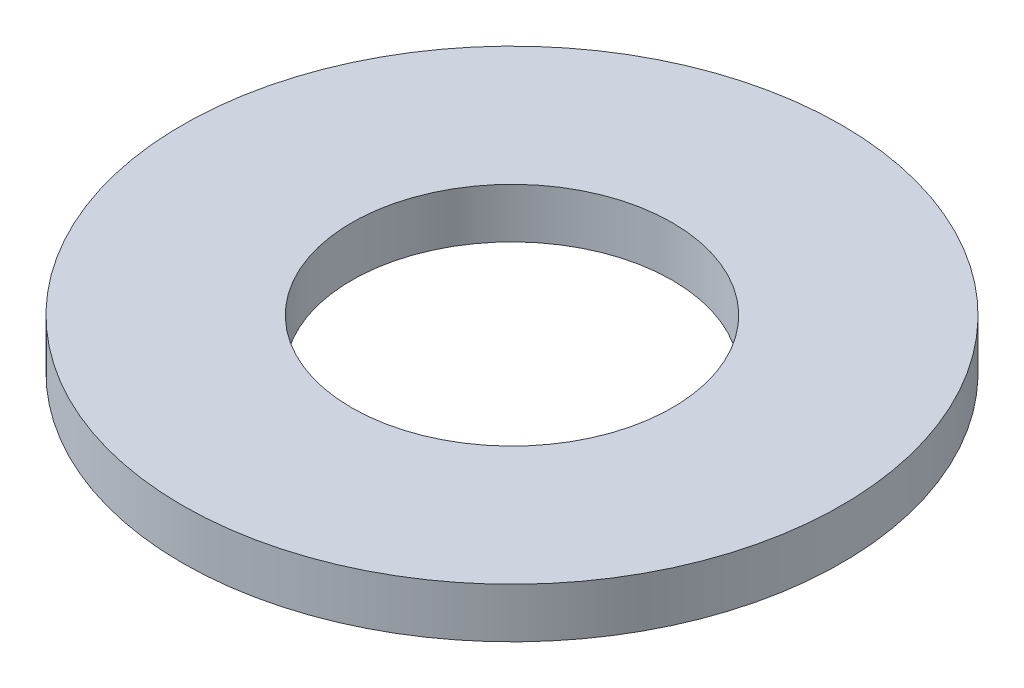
ISO-10303-21;
HEADER;
FILE_DESCRIPTION(('STEP AP214'),'2;1');
FILE_NAME('part.step','',(''),(''),'','','');
FILE_SCHEMA(('AUTOMOTIVE_DESIGN { 1 0 10303 214 1 1 1 1 }'));
ENDSEC;
DATA;
#1=APPLICATION_CONTEXT('core data for automotive mechanical design processes');
#2=APPLICATION_PROTOCOL_DEFINITION('international standard','automotive_design',2000,#1);
#3=PRODUCT_CONTEXT('',#1,'mechanical');
#4=PRODUCT('Part','Part','',(#3));
#5=PRODUCT_RELATED_PRODUCT_CATEGORY('part','',(#4));
#6=PRODUCT_DEFINITION_FORMATION('','',#4);
#7=PRODUCT_DEFINITION_CONTEXT('part definition',#1,'design');
#8=PRODUCT_DEFINITION('design','',#6,#7);
#9=PRODUCT_DEFINITION_SHAPE('','',#8);
#10=(LENGTH_UNIT() NAMED_UNIT(*) SI_UNIT(.MILLI.,.METRE.));
#11=(NAMED_UNIT(*) PLANE_ANGLE_UNIT() SI_UNIT($,.RADIAN.));
#12=(NAMED_UNIT(*) SI_UNIT($,.STERADIAN.) SOLID_ANGLE_UNIT());
#13=UNCERTAINTY_MEASURE_WITH_UNIT(LENGTH_MEASURE(1.E-05),#10,'distance_accuracy_value','');
#14=(GEOMETRIC_REPRESENTATION_CONTEXT(3) GLOBAL_UNCERTAINTY_ASSIGNED_CONTEXT((#13)) GLOBAL_UNIT_ASSIGNED_CONTEXT((#10,
#11,#12)) REPRESENTATION_CONTEXT('',''));
#15=CARTESIAN_POINT('',(0.,0.,0.));
#16=DIRECTION('',(0.,0.,1.));
#17=DIRECTION('',(1.,0.,0.));
#18=AXIS2_PLACEMENT_3D('',#15,#16,#17);
#19=CARTESIAN_POINT('',(0.,0.711200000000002,0.));
#20=DIRECTION('',(0.,-0.999999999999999,0.));
#21=DIRECTION('',(0.,0.,-1.));
#22=AXIS2_PLACEMENT_3D('',#19,#20,#21);
#23=CYLINDRICAL_SURFACE('',#22,4.699);
#24=CARTESIAN_POINT('',(0.,0.711200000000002,0.));
#25=DIRECTION('',(0.,0.999999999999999,0.));
#26=DIRECTION('',(0.,0.,1.));
#27=AXIS2_PLACEMENT_3D('',#24,#25,#26);
#28=CIRCLE('',#27,4.699);
#29=CARTESIAN_POINT('',(0.,0.711200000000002,-4.69899999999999));
#30=VERTEX_POINT('',#29);
#31=EDGE_CURVE('E10',#30,#30,#28,.T.);
#32=CARTESIAN_POINT('',(0.,0.,0.));
#33=DIRECTION('',(0.,0.999999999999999,0.));
#34=DIRECTION('',(0.,0.,1.));
#35=AXIS2_PLACEMENT_3D('',#32,#33,#34);
#36=CIRCLE('',#35,4.699);
#37=CARTESIAN_POINT('',(0.,0.,-4.69899999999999));
#38=VERTEX_POINT('',#37);
#39=EDGE_CURVE('E34',#38,#38,#36,.T.);
#40=CARTESIAN_POINT('',(0.,0.711200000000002,-4.69899999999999));
#41=CARTESIAN_POINT('',(0.,0.703791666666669,-4.69899999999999));
#42=CARTESIAN_POINT('',(0.,0.696383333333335,-4.69899999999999));
#43=CARTESIAN_POINT('',(0.,0.681566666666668,-4.69899999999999));
#44=CARTESIAN_POINT('',(0.,0.674158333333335,-4.69899999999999));
#45=CARTESIAN_POINT('',(0.,0.659341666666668,-4.69899999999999));
#46=CARTESIAN_POINT('',(0.,0.651933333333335,-4.69899999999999));
#47=CARTESIAN_POINT('',(0.,0.637116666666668,-4.69899999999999));
#48=CARTESIAN_POINT('',(0.,0.629708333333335,-4.69899999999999));
#49=CARTESIAN_POINT('',(0.,0.614891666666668,-4.69899999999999));
#50=CARTESIAN_POINT('',(0.,0.607483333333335,-4.69899999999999));
#51=CARTESIAN_POINT('',(0.,0.592666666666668,-4.69899999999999));
#52=CARTESIAN_POINT('',(0.,0.585258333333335,-4.69899999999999));
#53=CARTESIAN_POINT('',(0.,0.570441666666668,-4.69899999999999));
#54=CARTESIAN_POINT('',(0.,0.563033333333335,-4.69899999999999));
#55=CARTESIAN_POINT('',(0.,0.548216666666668,-4.69899999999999));
#56=CARTESIAN_POINT('',(0.,0.540808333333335,-4.69899999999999));
#57=CARTESIAN_POINT('',(0.,0.525991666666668,-4.69899999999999));
#58=CARTESIAN_POINT('',(0.,0.518583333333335,-4.69899999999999));
#59=CARTESIAN_POINT('',(0.,0.503766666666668,-4.69899999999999));
#60=CARTESIAN_POINT('',(0.,0.496358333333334,-4.69899999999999));
#61=CARTESIAN_POINT('',(0.,0.481541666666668,-4.69899999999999));
#62=CARTESIAN_POINT('',(0.,0.474133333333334,-4.69899999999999));
#63=CARTESIAN_POINT('',(0.,0.459316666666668,-4.69899999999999));
#64=CARTESIAN_POINT('',(0.,0.451908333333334,-4.69899999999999));
#65=CARTESIAN_POINT('',(0.,0.437091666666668,-4.69899999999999));
#66=CARTESIAN_POINT('',(0.,0.429683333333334,-4.69899999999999));
#67=CARTESIAN_POINT('',(0.,0.414866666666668,-4.69899999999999));
#68=CARTESIAN_POINT('',(0.,0.407458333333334,-4.69899999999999));
#69=CARTESIAN_POINT('',(0.,0.392641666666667,-4.69899999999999));
#70=CARTESIAN_POINT('',(0.,0.385233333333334,-4.69899999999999));
#71=CARTESIAN_POINT('',(0.,0.370416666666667,-4.69899999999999));
#72=CARTESIAN_POINT('',(0.,0.363008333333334,-4.69899999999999));
#73=CARTESIAN_POINT('',(0.,0.348191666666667,-4.69899999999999));
#74=CARTESIAN_POINT('',(0.,0.340783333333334,-4.69899999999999));
#75=CARTESIAN_POINT('',(0.,0.325966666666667,-4.69899999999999));
#76=CARTESIAN_POINT('',(0.,0.318558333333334,-4.69899999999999));
#77=CARTESIAN_POINT('',(0.,0.303741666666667,-4.69899999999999));
#78=CARTESIAN_POINT('',(0.,0.296333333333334,-4.69899999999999));
#79=CARTESIAN_POINT('',(0.,0.281516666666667,-4.69899999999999));
#80=CARTESIAN_POINT('',(0.,0.274108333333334,-4.69899999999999));
#81=CARTESIAN_POINT('',(0.,0.259291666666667,-4.69899999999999));
#82=CARTESIAN_POINT('',(0.,0.251883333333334,-4.69899999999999));
#83=CARTESIAN_POINT('',(0.,0.237066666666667,-4.69899999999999));
#84=CARTESIAN_POINT('',(0.,0.229658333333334,-4.69899999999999));
#85=CARTESIAN_POINT('',(0.,0.214841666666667,-4.69899999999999));
#86=CARTESIAN_POINT('',(0.,0.207433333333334,-4.69899999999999));
#87=CARTESIAN_POINT('',(0.,0.192616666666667,-4.69899999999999));
#88=CARTESIAN_POINT('',(0.,0.185208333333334,-4.69899999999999));
#89=CARTESIAN_POINT('',(0.,0.170391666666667,-4.69899999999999));
#90=CARTESIAN_POINT('',(0.,0.162983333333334,-4.69899999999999));
#91=CARTESIAN_POINT('',(0.,0.148166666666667,-4.69899999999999));
#92=CARTESIAN_POINT('',(0.,0.140758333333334,-4.69899999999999));
#93=CARTESIAN_POINT('',(0.,0.125941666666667,-4.69899999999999));
#94=CARTESIAN_POINT('',(0.,0.118533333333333,-4.69899999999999));
#95=CARTESIAN_POINT('',(0.,0.103716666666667,-4.69899999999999));
#96=CARTESIAN_POINT('',(0.,0.0963083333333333,-4.69899999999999));
#97=CARTESIAN_POINT('',(0.,0.0814916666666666,-4.69899999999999));
#98=CARTESIAN_POINT('',(0.,0.0740833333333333,-4.69899999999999));
#99=CARTESIAN_POINT('',(0.,0.0592666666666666,-4.69899999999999));
#100=CARTESIAN_POINT('',(0.,0.0518583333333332,-4.69899999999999));
#101=CARTESIAN_POINT('',(0.,0.0370416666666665,-4.69899999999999));
#102=CARTESIAN_POINT('',(0.,0.0296333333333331,-4.69899999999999));
#103=CARTESIAN_POINT('',(0.,0.0148166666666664,-4.69899999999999));
#104=CARTESIAN_POINT('',(0.,0.00740833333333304,-4.69899999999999));
#105=CARTESIAN_POINT('',(0.,0.,-4.69899999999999));
#106=B_SPLINE_CURVE_WITH_KNOTS('',3,(#40,#41,#42,#43,#44,#45,#46,#47,#48,#49,#50,#51,#52,#53,
#54,#55,#56,#57,#58,#59,#60,#61,#62,#63,#64,#65,#66,#67,#68,#69,#70,#71,#72,#73,#74,#75,#76,#77,
#78,#79,#80,#81,#82,#83,#84,#85,#86,#87,#88,#89,#90,#91,#92,#93,#94,#95,#96,#97,#98,#99,#100,
#101,#102,#103,#104,#105),.UNSPECIFIED.,.F.,.F.,(4,2,2,2,2,2,2,2,2,2,2,2,2,2,2,2,2,2,2,2,2,2,2,
2,2,2,2,2,2,2,2,2,4),(0.,0.0222250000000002,0.0444500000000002,0.0666750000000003,
0.0889000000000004,0.111125,0.13335,0.155575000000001,0.177800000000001,0.200025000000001,
0.222250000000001,0.244475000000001,0.266700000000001,0.288925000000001,0.311150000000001,
0.333375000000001,0.355600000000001,0.377825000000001,0.400050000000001,0.422275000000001,
0.444500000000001,0.466725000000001,0.488950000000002,0.511175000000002,0.533400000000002,
0.555625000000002,0.577850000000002,0.600075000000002,0.622300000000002,0.644525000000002,
0.666750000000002,0.688975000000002,0.711200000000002),.UNSPECIFIED.);
#107=EDGE_CURVE('BSEAM28',#30,#38,#106,.T.);
#108=ORIENTED_EDGE('',*,*,#31,.F.);
#109=ORIENTED_EDGE('',*,*,#39,.T.);
#110=ORIENTED_EDGE('',*,*,#107,.T.);
#111=ORIENTED_EDGE('',*,*,#107,.F.);
#112=EDGE_LOOP('',(#108,#110,#109,#111));
#113=FACE_BOUND('',#112,.T.);
#114=ADVANCED_FACE('F28',(#113),#23,.T.);
#115=CARTESIAN_POINT('',(0.,0.711200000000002,0.));
#116=DIRECTION('',(0.,0.999999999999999,0.));
#117=DIRECTION('',(0.,0.,1.));
#118=AXIS2_PLACEMENT_3D('',#115,#116,#117);
#119=PLANE('',#118);
#120=CARTESIAN_POINT('',(0.,0.711200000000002,0.));
#121=DIRECTION('',(0.,-0.999999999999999,0.));
#122=DIRECTION('',(0.,0.,-1.));
#123=AXIS2_PLACEMENT_3D('',#120,#121,#122);
#124=CIRCLE('',#123,2.286);
#125=CARTESIAN_POINT('',(0.,0.711200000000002,-2.28599999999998));
#126=VERTEX_POINT('',#125);
#127=EDGE_CURVE('E38',#126,#126,#124,.T.);
#128=ORIENTED_EDGE('',*,*,#127,.T.);
#129=EDGE_LOOP('',(#128));
#130=FACE_BOUND('',#129,.T.);
#131=ORIENTED_EDGE('',*,*,#31,.T.);
#132=EDGE_LOOP('',(#131));
#133=FACE_BOUND('',#132,.T.);
#134=ADVANCED_FACE('F53',(#130,#133),#119,.T.);
#135=CARTESIAN_POINT('',(0.,0.,0.));
#136=DIRECTION('',(0.,0.999999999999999,0.));
#137=DIRECTION('',(0.,0.,1.));
#138=AXIS2_PLACEMENT_3D('',#135,#136,#137);
#139=PLANE('',#138);
#140=CARTESIAN_POINT('',(0.,0.,0.));
#141=DIRECTION('',(0.,-0.999999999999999,0.));
#142=DIRECTION('',(0.,0.,-1.));
#143=AXIS2_PLACEMENT_3D('',#140,#141,#142);
#144=CIRCLE('',#143,2.286);
#145=CARTESIAN_POINT('',(0.,0.,-2.28599999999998));
#146=VERTEX_POINT('',#145);
#147=EDGE_CURVE('E42',#146,#146,#144,.T.);
#148=ORIENTED_EDGE('',*,*,#147,.F.);
#149=EDGE_LOOP('',(#148));
#150=FACE_BOUND('',#149,.T.);
#151=ORIENTED_EDGE('',*,*,#39,.F.);
#152=EDGE_LOOP('',(#151));
#153=FACE_BOUND('',#152,.T.);
#154=ADVANCED_FACE('F50',(#150,#153),#139,.F.);
#155=CARTESIAN_POINT('',(0.,0.711200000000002,0.));
#156=DIRECTION('',(0.,-0.999999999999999,0.));
#157=DIRECTION('',(0.,0.,-1.));
#158=AXIS2_PLACEMENT_3D('',#155,#156,#157);
#159=CYLINDRICAL_SURFACE('',#158,2.286);
#160=CARTESIAN_POINT('',(0.,0.711200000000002,-2.28599999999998));
#161=CARTESIAN_POINT('',(0.,0.703791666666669,-2.28599999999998));
#162=CARTESIAN_POINT('',(0.,0.696383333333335,-2.28599999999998));
#163=CARTESIAN_POINT('',(0.,0.681566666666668,-2.28599999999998));
#164=CARTESIAN_POINT('',(0.,0.674158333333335,-2.28599999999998));
#165=CARTESIAN_POINT('',(0.,0.659341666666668,-2.28599999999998));
#166=CARTESIAN_POINT('',(0.,0.651933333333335,-2.28599999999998));
#167=CARTESIAN_POINT('',(0.,0.637116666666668,-2.28599999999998));
#168=CARTESIAN_POINT('',(0.,0.629708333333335,-2.28599999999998));
#169=CARTESIAN_POINT('',(0.,0.614891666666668,-2.28599999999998));
#170=CARTESIAN_POINT('',(0.,0.607483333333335,-2.28599999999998));
#171=CARTESIAN_POINT('',(0.,0.592666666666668,-2.28599999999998));
#172=CARTESIAN_POINT('',(0.,0.585258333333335,-2.28599999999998));
#173=CARTESIAN_POINT('',(0.,0.570441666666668,-2.28599999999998));
#174=CARTESIAN_POINT('',(0.,0.563033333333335,-2.28599999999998));
#175=CARTESIAN_POINT('',(0.,0.548216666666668,-2.28599999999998));
#176=CARTESIAN_POINT('',(0.,0.540808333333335,-2.28599999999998));
#177=CARTESIAN_POINT('',(0.,0.525991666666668,-2.28599999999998));
#178=CARTESIAN_POINT('',(0.,0.518583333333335,-2.28599999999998));
#179=CARTESIAN_POINT('',(0.,0.503766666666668,-2.28599999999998));
#180=CARTESIAN_POINT('',(0.,0.496358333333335,-2.28599999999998));
#181=CARTESIAN_POINT('',(0.,0.481541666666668,-2.28599999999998));
#182=CARTESIAN_POINT('',(0.,0.474133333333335,-2.28599999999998));
#183=CARTESIAN_POINT('',(0.,0.459316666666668,-2.28599999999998));
#184=CARTESIAN_POINT('',(0.,0.451908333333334,-2.28599999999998));
#185=CARTESIAN_POINT('',(0.,0.437091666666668,-2.28599999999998));
#186=CARTESIAN_POINT('',(0.,0.429683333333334,-2.28599999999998));
#187=CARTESIAN_POINT('',(0.,0.414866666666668,-2.28599999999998));
#188=CARTESIAN_POINT('',(0.,0.407458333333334,-2.28599999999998));
#189=CARTESIAN_POINT('',(0.,0.392641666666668,-2.28599999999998));
#190=CARTESIAN_POINT('',(0.,0.385233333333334,-2.28599999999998));
#191=CARTESIAN_POINT('',(0.,0.370416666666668,-2.28599999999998));
#192=CARTESIAN_POINT('',(0.,0.363008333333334,-2.28599999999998));
#193=CARTESIAN_POINT('',(0.,0.348191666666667,-2.28599999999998));
#194=CARTESIAN_POINT('',(0.,0.340783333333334,-2.28599999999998));
#195=CARTESIAN_POINT('',(0.,0.325966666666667,-2.28599999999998));
#196=CARTESIAN_POINT('',(0.,0.318558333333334,-2.28599999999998));
#197=CARTESIAN_POINT('',(0.,0.303741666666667,-2.28599999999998));
#198=CARTESIAN_POINT('',(0.,0.296333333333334,-2.28599999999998));
#199=CARTESIAN_POINT('',(0.,0.281516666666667,-2.28599999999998));
#200=CARTESIAN_POINT('',(0.,0.274108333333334,-2.28599999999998));
#201=CARTESIAN_POINT('',(0.,0.259291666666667,-2.28599999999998));
#202=CARTESIAN_POINT('',(0.,0.251883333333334,-2.28599999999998));
#203=CARTESIAN_POINT('',(0.,0.237066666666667,-2.28599999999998));
#204=CARTESIAN_POINT('',(0.,0.229658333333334,-2.28599999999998));
#205=CARTESIAN_POINT('',(0.,0.214841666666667,-2.28599999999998));
#206=CARTESIAN_POINT('',(0.,0.207433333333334,-2.28599999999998));
#207=CARTESIAN_POINT('',(0.,0.192616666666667,-2.28599999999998));
#208=CARTESIAN_POINT('',(0.,0.185208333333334,-2.28599999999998));
#209=CARTESIAN_POINT('',(0.,0.170391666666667,-2.28599999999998));
#210=CARTESIAN_POINT('',(0.,0.162983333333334,-2.28599999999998));
#211=CARTESIAN_POINT('',(0.,0.148166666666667,-2.28599999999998));
#212=CARTESIAN_POINT('',(0.,0.140758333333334,-2.28599999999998));
#213=CARTESIAN_POINT('',(0.,0.125941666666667,-2.28599999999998));
#214=CARTESIAN_POINT('',(0.,0.118533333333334,-2.28599999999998));
#215=CARTESIAN_POINT('',(0.,0.103716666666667,-2.28599999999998));
#216=CARTESIAN_POINT('',(0.,0.0963083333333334,-2.28599999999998));
#217=CARTESIAN_POINT('',(0.,0.0814916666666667,-2.28599999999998));
#218=CARTESIAN_POINT('',(0.,0.0740833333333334,-2.28599999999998));
#219=CARTESIAN_POINT('',(0.,0.0592666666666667,-2.28599999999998));
#220=CARTESIAN_POINT('',(0.,0.0518583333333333,-2.28599999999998));
#221=CARTESIAN_POINT('',(0.,0.0370416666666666,-2.28599999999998));
#222=CARTESIAN_POINT('',(0.,0.0296333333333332,-2.28599999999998));
#223=CARTESIAN_POINT('',(0.,0.0148166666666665,-2.28599999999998));
#224=CARTESIAN_POINT('',(0.,0.00740833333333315,-2.28599999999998));
#225=CARTESIAN_POINT('',(0.,0.,-2.28599999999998));
#226=B_SPLINE_CURVE_WITH_KNOTS('',3,(#160,#161,#162,#163,#164,#165,#166,#167,#168,#169,#170,
#171,#172,#173,#174,#175,#176,#177,#178,#179,#180,#181,#182,#183,#184,#185,#186,#187,#188,#189,
#190,#191,#192,#193,#194,#195,#196,#197,#198,#199,#200,#201,#202,#203,#204,#205,#206,#207,#208,
#209,#210,#211,#212,#213,#214,#215,#216,#217,#218,#219,#220,#221,#222,#223,#224,#225),
.UNSPECIFIED.,.F.,.F.,(4,2,2,2,2,2,2,2,2,2,2,2,2,2,2,2,2,2,2,2,2,2,2,2,2,2,2,2,2,2,2,2,4),(0.,
0.0222250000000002,0.0444500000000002,0.0666750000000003,0.0889000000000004,0.111125,0.13335,
0.155575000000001,0.177800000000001,0.200025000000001,0.222250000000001,0.244475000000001,
0.266700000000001,0.288925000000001,0.311150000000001,0.333375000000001,0.355600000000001,
0.377825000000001,0.400050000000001,0.422275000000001,0.444500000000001,0.466725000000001,
0.488950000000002,0.511175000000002,0.533400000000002,0.555625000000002,0.577850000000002,
0.600075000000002,0.622300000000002,0.644525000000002,0.666750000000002,0.688975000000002,
0.711200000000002),.UNSPECIFIED.);
#227=EDGE_CURVE('BSEAM48',#126,#146,#226,.T.);
#228=ORIENTED_EDGE('',*,*,#127,.F.);
#229=ORIENTED_EDGE('',*,*,#147,.T.);
#230=ORIENTED_EDGE('',*,*,#227,.T.);
#231=ORIENTED_EDGE('',*,*,#227,.F.);
#232=EDGE_LOOP('',(#228,#230,#229,#231));
#233=FACE_BOUND('',#232,.T.);
#234=ADVANCED_FACE('F48',(#233),#159,.F.);
#235=CLOSED_SHELL('',(#114,#134,#154,#234));
#236=MANIFOLD_SOLID_BREP('B2',#235);
#237=ADVANCED_BREP_SHAPE_REPRESENTATION('',(#18,#236),#14);
#238=SHAPE_DEFINITION_REPRESENTATION(#9,#237);
ENDSEC;
END-ISO-10303-21;
